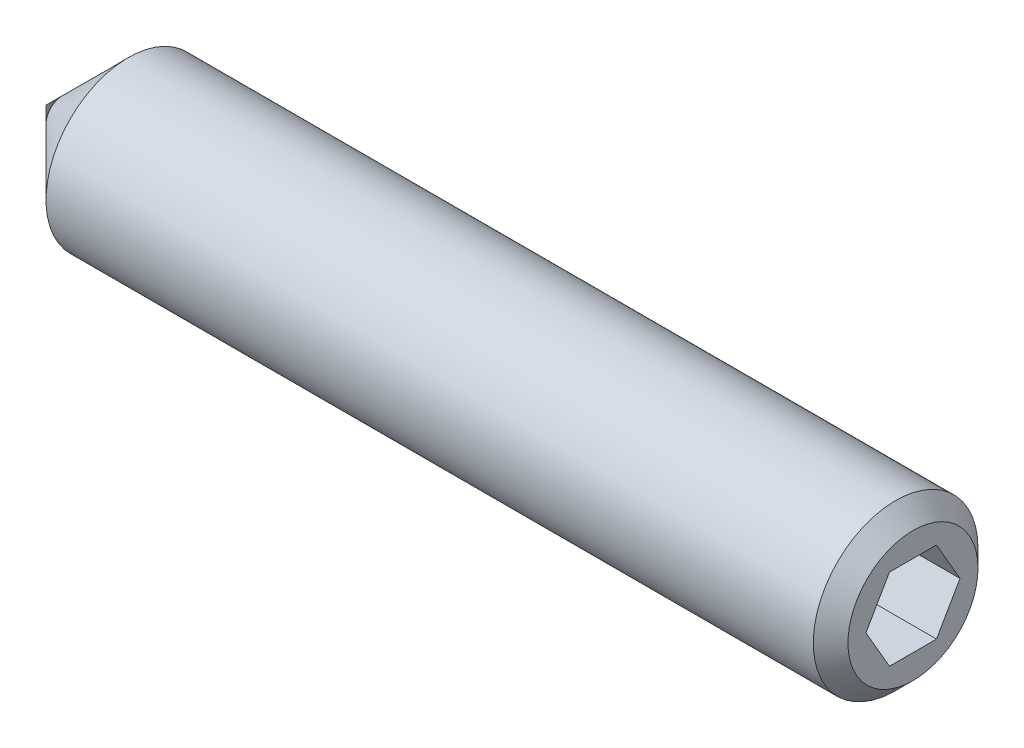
from build123d import *

# Parameters (mm, degrees)
CHAMFER1_SIZE      = 0.508
CUT_EXTRUDE1_DEPTH = 3.048


with BuildPart() as part:
    # Sketch1 → Base (revolve)
    with BuildSketch(Plane.XY, mode=Mode.PRIVATE) as base_sk:
        Polygon((0, 0), (2.413, 2.413), (25.4, 2.413), (25.4, 0), align=None)
    revolve(base_sk.sketch.rotate(Axis((0, 0, 0), (-1, 0, 0)), 90), axis=Axis((0, 0, 0), (-1, 0, 0)))

    # Chamfer1
    chamfer1_edges = [part.edges().sort_by_distance(p)[0] for p in [
        (25.4, 0, 2.413),
    ]]
    chamfer(chamfer1_edges, length=CHAMFER1_SIZE)

    # Hexagon - circumscribed1 → Cut-Extrude1 (cut)
    with BuildSketch(Plane(origin=(25.4, -0.601280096, -0.503166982), x_dir=(0, 0, -1), z_dir=(1, 0, 0))):
        Polygon((-1.192407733, 1.795080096), (0.18607377, 1.795080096), (0.875314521, 0.601280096), (0.18607377, -0.592519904), (-1.192407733, -0.592519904), (-1.881648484, 0.601280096), align=None)
    extrude(amount=-CUT_EXTRUDE1_DEPTH, mode=Mode.SUBTRACT)


solid = part.part
